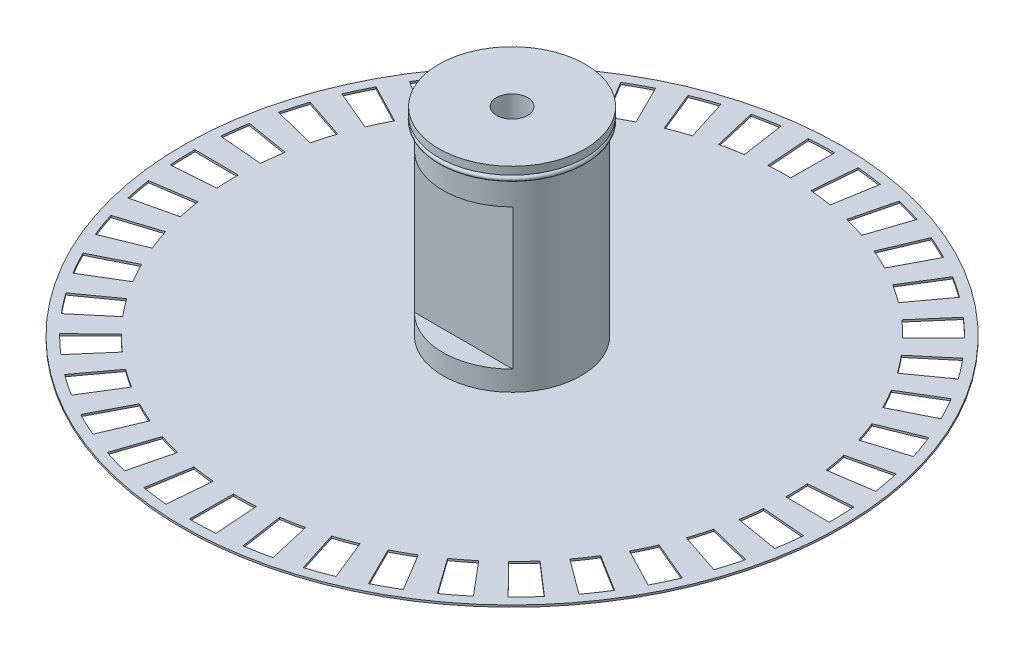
from build123d import *

# Parameters (mm, degrees)
ENL_V_MAT_EXTRU_1_DEPTH = 53.349689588
ESQUISSE3_W             = 23.080087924
ESQUISSE3_H             = 14.488991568
ENL_V_MAT_EXTRU_2_DEPTH = 5


with BuildPart() as part:
    # Esquisse1 → R_volution1 (revolve)
    with BuildSketch(Plane.XY, mode=Mode.PRIVATE) as r_volution1_sk:
        with BuildLine():
            Line((-1.6, 0), (-24, 0))
            Line((-24, 0), (-24, 1.6))
            Line((-24, 1.6), (-34, 1.6))
            Line((-34, 1.6), (-34, 1.8))
            Line((-34, 1.8), (-7.125, 1.8))
            Line((-7.125, 1.8), (-7.125, 20.94))
            ThreePointArc((-7.125, 20.94), (-7.575, 21.09), (-7.125, 21.24))
            Line((-7.125, 21.24), (-7.125, 21.5))
            Line((-7.125, 21.5), (-7.5562444, 21.5))
            Line((-7.5562444, 21.5), (-7.5562444, 22.3))
            Line((-7.5562444, 22.3), (-1.6, 22.3))
            Line((-1.6, 22.3), (-1.6, 0))
        make_face()
    revolve(r_volution1_sk.sketch.rotate(Axis((0, 0, 0), (0, 1, 0)), 270), axis=Axis((0, 0, 0), (0, 1, 0)))

    # Esquisse2 → Enl_v. mat.-Extru.1 (cut, through all)
    with BuildSketch(Plane.XZ.offset(-1.6)):
        with BuildLine():
            Line((-0.248706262, 28.498914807), (-0.287975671, 32.998743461))
            ThreePointArc((-0.287975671, 32.998743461), (1.03655505, 32.983716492), (2.359415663, 32.915545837))
            Line((2.359415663, 32.915545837), (2.037677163, 28.427062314))
            ThreePointArc((2.037677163, 28.427062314), (0.895206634, 28.48593697), (-0.248706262, 28.498914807))
        make_face()
        with BuildLine():
            Line((4.212568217, 28.186952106), (4.877710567, 32.637523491))
            ThreePointArc((4.877710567, 32.637523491), (6.183583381, 32.415479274), (7.479493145, 32.14120692))
            Line((7.479493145, 32.14120692), (6.459562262, 27.758315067))
            ThreePointArc((6.459562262, 27.758315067), (5.340367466, 27.995186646), (4.212568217, 28.186952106))
        make_face()
        with BuildLine():
            Line((8.570115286, 27.180933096), (9.923291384, 31.472659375))
            ThreePointArc((9.923291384, 31.472659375), (11.178351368, 31.049065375), (12.415400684, 30.575444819))
            Line((12.415400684, 30.575444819), (10.722391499, 26.40606598))
            ThreePointArc((10.722391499, 26.40606598), (9.654030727, 26.815101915), (8.570115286, 27.180933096))
        make_face()
        with BuildLine():
            Line((12.716637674, 25.505629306), (14.724527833, 29.532833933))
            ThreePointArc((14.724527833, 29.532833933), (15.897871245, 28.918120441), (17.045599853, 28.256813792))
            Line((17.045599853, 28.256813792), (14.721199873, 24.403611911))
            ThreePointArc((14.721199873, 24.403611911), (13.729979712, 24.974740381), (12.716637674, 25.505629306))
        make_face()
        with BuildLine():
            Line((16.550034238, 23.202292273), (19.163197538, 26.865812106))
            ThreePointArc((19.163197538, 26.865812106), (20.225932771, 26.075115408), (21.256079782, 25.24240623))
            Line((21.256079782, 25.24240623), (18.357523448, 21.800259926))
            ThreePointArc((18.357523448, 21.800259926), (17.467851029, 22.519417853), (16.550034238, 23.202292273))
        make_face()
        with BuildLine():
            Line((19.975914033, 20.327637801), (23.130005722, 23.537264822))
            ThreePointArc((23.130005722, 23.537264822), (24.055964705, 22.590054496), (24.943164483, 21.606446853))
            Line((24.943164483, 21.606446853), (21.541823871, 18.660113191))
            ThreePointArc((21.541823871, 18.660113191), (20.775605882, 19.509592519), (19.975914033, 20.327637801))
        make_face()
        with BuildLine():
            Line((22.909920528, 16.952449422), (26.5272764, 19.629151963))
            ThreePointArc((26.5272764, 19.629151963), (27.293658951, 18.548751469), (28.016065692, 17.438465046))
            Line((28.016065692, 17.438465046), (24.195693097, 15.06049254))
            ThreePointArc((24.195693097, 15.06049254), (23.571796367, 16.019376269), (22.909920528, 16.952449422))
        make_face()
        with BuildLine():
            Line((25.279808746, 13.159835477), (29.271357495, 15.237704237))
            ThreePointArc((29.271357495, 15.237704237), (29.859292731, 14.050716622), (30.399118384, 12.841090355))
            Line((30.399118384, 12.841090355), (26.253784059, 11.090032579))
            ThreePointArc((26.253784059, 11.090032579), (25.787570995, 12.13470981), (25.279808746, 13.159835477))
        make_face()
        with BuildLine():
            Line((27.027224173, 9.043182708), (31.294680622, 10.471053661))
            ThreePointArc((31.294680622, 10.471053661), (31.689691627, 9.206706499), (32.033643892, 7.927525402))
            Line((32.033643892, 7.927525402), (27.665419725, 6.846499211))
            ThreePointArc((27.665419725, 6.846499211), (27.368370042, 7.951246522), (27.027224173, 9.043182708))
        make_face()
        with BuildLine():
            Line((28.109139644, 4.703856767), (32.547424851, 5.446570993))
            ThreePointArc((32.547424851, 5.446570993), (32.739785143, 4.135996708), (32.879394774, 2.818758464))
            Line((32.879394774, 2.818758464), (28.395840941, 2.434382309))
            ThreePointArc((28.395840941, 2.434382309), (28.275268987, 3.571997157), (28.109139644, 4.703856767))
        make_face()
        with BuildLine():
            Line((28.498914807, 0.248706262), (32.998743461, 0.287975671))
            ThreePointArc((32.998743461, 0.287975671), (32.983716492, -1.03655505), (32.915545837, -2.359415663))
            Line((32.915545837, -2.359415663), (28.427062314, -2.037677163))
            ThreePointArc((28.427062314, -2.037677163), (28.48593697, -0.895206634), (28.498914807, 0.248706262))
        make_face()
        with BuildLine():
            Line((28.186952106, -4.212568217), (32.637523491, -4.877710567))
            ThreePointArc((32.637523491, -4.877710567), (32.415479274, -6.183583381), (32.14120692, -7.479493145))
            Line((32.14120692, -7.479493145), (27.758315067, -6.459562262))
            ThreePointArc((27.758315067, -6.459562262), (27.995186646, -5.340367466), (28.186952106, -4.212568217))
        make_face()
        with BuildLine():
            Line((27.180933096, -8.570115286), (31.472659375, -9.923291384))
            ThreePointArc((31.472659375, -9.923291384), (31.049065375, -11.178351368), (30.575444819, -12.415400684))
            Line((30.575444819, -12.415400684), (26.40606598, -10.722391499))
            ThreePointArc((26.40606598, -10.722391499), (26.815101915, -9.654030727), (27.180933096, -8.570115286))
        make_face()
        with BuildLine():
            Line((25.505629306, -12.716637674), (29.532833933, -14.724527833))
            ThreePointArc((29.532833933, -14.724527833), (28.918120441, -15.897871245), (28.256813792, -17.045599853))
            Line((28.256813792, -17.045599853), (24.403611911, -14.721199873))
            ThreePointArc((24.403611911, -14.721199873), (24.974740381, -13.729979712), (25.505629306, -12.716637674))
        make_face()
        with BuildLine():
            Line((23.202292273, -16.550034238), (26.865812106, -19.163197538))
            ThreePointArc((26.865812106, -19.163197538), (26.075115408, -20.225932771), (25.24240623, -21.256079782))
            Line((25.24240623, -21.256079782), (21.800259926, -18.357523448))
            ThreePointArc((21.800259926, -18.357523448), (22.519417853, -17.467851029), (23.202292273, -16.550034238))
        make_face()
        with BuildLine():
            Line((20.327637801, -19.975914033), (23.537264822, -23.130005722))
            ThreePointArc((23.537264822, -23.130005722), (22.590054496, -24.055964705), (21.606446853, -24.943164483))
            Line((21.606446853, -24.943164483), (18.660113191, -21.541823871))
            ThreePointArc((18.660113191, -21.541823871), (19.509592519, -20.775605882), (20.327637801, -19.975914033))
        make_face()
        with BuildLine():
            Line((16.952449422, -22.909920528), (19.629151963, -26.5272764))
            ThreePointArc((19.629151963, -26.5272764), (18.548751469, -27.293658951), (17.438465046, -28.016065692))
            Line((17.438465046, -28.016065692), (15.06049254, -24.195693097))
            ThreePointArc((15.06049254, -24.195693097), (16.019376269, -23.571796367), (16.952449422, -22.909920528))
        make_face()
        with BuildLine():
            Line((13.159835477, -25.279808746), (15.237704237, -29.271357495))
            ThreePointArc((15.237704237, -29.271357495), (14.050716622, -29.859292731), (12.841090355, -30.399118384))
            Line((12.841090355, -30.399118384), (11.090032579, -26.253784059))
            ThreePointArc((11.090032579, -26.253784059), (12.13470981, -25.787570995), (13.159835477, -25.279808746))
        make_face()
        with BuildLine():
            Line((9.043182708, -27.027224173), (10.471053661, -31.294680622))
            ThreePointArc((10.471053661, -31.294680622), (9.206706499, -31.689691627), (7.927525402, -32.033643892))
            Line((7.927525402, -32.033643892), (6.846499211, -27.665419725))
            ThreePointArc((6.846499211, -27.665419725), (7.951246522, -27.368370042), (9.043182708, -27.027224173))
        make_face()
        with BuildLine():
            Line((4.703856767, -28.109139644), (5.446570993, -32.547424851))
            ThreePointArc((5.446570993, -32.547424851), (4.135996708, -32.739785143), (2.818758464, -32.879394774))
            Line((2.818758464, -32.879394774), (2.434382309, -28.395840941))
            ThreePointArc((2.434382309, -28.395840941), (3.571997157, -28.275268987), (4.703856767, -28.109139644))
        make_face()
        with BuildLine():
            Line((0.248706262, -28.498914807), (0.287975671, -32.998743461))
            ThreePointArc((0.287975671, -32.998743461), (-1.03655505, -32.983716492), (-2.359415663, -32.915545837))
            Line((-2.359415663, -32.915545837), (-2.037677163, -28.427062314))
            ThreePointArc((-2.037677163, -28.427062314), (-0.895206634, -28.48593697), (0.248706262, -28.498914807))
        make_face()
        with BuildLine():
            Line((-4.212568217, -28.186952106), (-4.877710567, -32.637523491))
            ThreePointArc((-4.877710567, -32.637523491), (-6.183583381, -32.415479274), (-7.479493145, -32.14120692))
            Line((-7.479493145, -32.14120692), (-6.459562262, -27.758315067))
            ThreePointArc((-6.459562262, -27.758315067), (-5.340367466, -27.995186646), (-4.212568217, -28.186952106))
        make_face()
        with BuildLine():
            Line((-8.570115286, -27.180933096), (-9.923291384, -31.472659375))
            ThreePointArc((-9.923291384, -31.472659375), (-11.178351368, -31.049065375), (-12.415400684, -30.575444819))
            Line((-12.415400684, -30.575444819), (-10.722391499, -26.40606598))
            ThreePointArc((-10.722391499, -26.40606598), (-9.654030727, -26.815101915), (-8.570115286, -27.180933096))
        make_face()
        with BuildLine():
            Line((-12.716637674, -25.505629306), (-14.724527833, -29.532833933))
            ThreePointArc((-14.724527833, -29.532833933), (-15.897871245, -28.918120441), (-17.045599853, -28.256813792))
            Line((-17.045599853, -28.256813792), (-14.721199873, -24.403611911))
            ThreePointArc((-14.721199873, -24.403611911), (-13.729979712, -24.974740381), (-12.716637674, -25.505629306))
        make_face()
        with BuildLine():
            Line((-16.550034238, -23.202292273), (-19.163197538, -26.865812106))
            ThreePointArc((-19.163197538, -26.865812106), (-20.225932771, -26.075115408), (-21.256079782, -25.24240623))
            Line((-21.256079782, -25.24240623), (-18.357523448, -21.800259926))
            ThreePointArc((-18.357523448, -21.800259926), (-17.467851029, -22.519417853), (-16.550034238, -23.202292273))
        make_face()
        with BuildLine():
            Line((-19.975914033, -20.327637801), (-23.130005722, -23.537264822))
            ThreePointArc((-23.130005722, -23.537264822), (-24.055964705, -22.590054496), (-24.943164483, -21.606446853))
            Line((-24.943164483, -21.606446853), (-21.541823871, -18.660113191))
            ThreePointArc((-21.541823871, -18.660113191), (-20.775605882, -19.509592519), (-19.975914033, -20.327637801))
        make_face()
        with BuildLine():
            Line((-22.909920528, -16.952449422), (-26.5272764, -19.629151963))
            ThreePointArc((-26.5272764, -19.629151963), (-27.293658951, -18.548751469), (-28.016065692, -17.438465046))
            Line((-28.016065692, -17.438465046), (-24.195693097, -15.06049254))
            ThreePointArc((-24.195693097, -15.06049254), (-23.571796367, -16.019376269), (-22.909920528, -16.952449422))
        make_face()
        with BuildLine():
            Line((-25.279808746, -13.159835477), (-29.271357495, -15.237704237))
            ThreePointArc((-29.271357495, -15.237704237), (-29.859292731, -14.050716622), (-30.399118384, -12.841090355))
            Line((-30.399118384, -12.841090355), (-26.253784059, -11.090032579))
            ThreePointArc((-26.253784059, -11.090032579), (-25.787570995, -12.13470981), (-25.279808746, -13.159835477))
        make_face()
        with BuildLine():
            Line((-27.027224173, -9.043182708), (-31.294680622, -10.471053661))
            ThreePointArc((-31.294680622, -10.471053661), (-31.689691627, -9.206706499), (-32.033643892, -7.927525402))
            Line((-32.033643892, -7.927525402), (-27.665419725, -6.846499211))
            ThreePointArc((-27.665419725, -6.846499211), (-27.368370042, -7.951246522), (-27.027224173, -9.043182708))
        make_face()
        with BuildLine():
            Line((-28.109139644, -4.703856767), (-32.547424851, -5.446570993))
            ThreePointArc((-32.547424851, -5.446570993), (-32.739785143, -4.135996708), (-32.879394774, -2.818758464))
            Line((-32.879394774, -2.818758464), (-28.395840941, -2.434382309))
            ThreePointArc((-28.395840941, -2.434382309), (-28.275268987, -3.571997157), (-28.109139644, -4.703856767))
        make_face()
        with BuildLine():
            Line((-28.498914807, -0.248706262), (-32.998743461, -0.287975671))
            ThreePointArc((-32.998743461, -0.287975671), (-32.983716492, 1.03655505), (-32.915545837, 2.359415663))
            Line((-32.915545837, 2.359415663), (-28.427062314, 2.037677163))
            ThreePointArc((-28.427062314, 2.037677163), (-28.48593697, 0.895206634), (-28.498914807, -0.248706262))
        make_face()
        with BuildLine():
            Line((-28.186952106, 4.212568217), (-32.637523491, 4.877710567))
            ThreePointArc((-32.637523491, 4.877710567), (-32.415479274, 6.183583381), (-32.14120692, 7.479493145))
            Line((-32.14120692, 7.479493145), (-27.758315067, 6.459562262))
            ThreePointArc((-27.758315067, 6.459562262), (-27.995186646, 5.340367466), (-28.186952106, 4.212568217))
        make_face()
        with BuildLine():
            Line((-27.180933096, 8.570115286), (-31.472659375, 9.923291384))
            ThreePointArc((-31.472659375, 9.923291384), (-31.049065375, 11.178351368), (-30.575444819, 12.415400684))
            Line((-30.575444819, 12.415400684), (-26.40606598, 10.722391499))
            ThreePointArc((-26.40606598, 10.722391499), (-26.815101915, 9.654030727), (-27.180933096, 8.570115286))
        make_face()
        with BuildLine():
            Line((-25.505629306, 12.716637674), (-29.532833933, 14.724527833))
            ThreePointArc((-29.532833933, 14.724527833), (-28.918120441, 15.897871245), (-28.256813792, 17.045599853))
            Line((-28.256813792, 17.045599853), (-24.403611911, 14.721199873))
            ThreePointArc((-24.403611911, 14.721199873), (-24.974740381, 13.729979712), (-25.505629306, 12.716637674))
        make_face()
        with BuildLine():
            Line((-23.202292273, 16.550034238), (-26.865812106, 19.163197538))
            ThreePointArc((-26.865812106, 19.163197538), (-26.075115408, 20.225932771), (-25.24240623, 21.256079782))
            Line((-25.24240623, 21.256079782), (-21.800259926, 18.357523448))
            ThreePointArc((-21.800259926, 18.357523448), (-22.519417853, 17.467851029), (-23.202292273, 16.550034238))
        make_face()
        with BuildLine():
            Line((-20.327637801, 19.975914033), (-23.537264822, 23.130005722))
            ThreePointArc((-23.537264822, 23.130005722), (-22.590054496, 24.055964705), (-21.606446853, 24.943164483))
            Line((-21.606446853, 24.943164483), (-18.660113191, 21.541823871))
            ThreePointArc((-18.660113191, 21.541823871), (-19.509592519, 20.775605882), (-20.327637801, 19.975914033))
        make_face()
        with BuildLine():
            Line((-16.952449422, 22.909920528), (-19.629151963, 26.5272764))
            ThreePointArc((-19.629151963, 26.5272764), (-18.548751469, 27.293658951), (-17.438465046, 28.016065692))
            Line((-17.438465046, 28.016065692), (-15.06049254, 24.195693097))
            ThreePointArc((-15.06049254, 24.195693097), (-16.019376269, 23.571796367), (-16.952449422, 22.909920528))
        make_face()
        with BuildLine():
            Line((-13.159835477, 25.279808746), (-15.237704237, 29.271357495))
            ThreePointArc((-15.237704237, 29.271357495), (-14.050716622, 29.859292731), (-12.841090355, 30.399118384))
            Line((-12.841090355, 30.399118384), (-11.090032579, 26.253784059))
            ThreePointArc((-11.090032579, 26.253784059), (-12.13470981, 25.787570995), (-13.159835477, 25.279808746))
        make_face()
        with BuildLine():
            Line((-9.043182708, 27.027224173), (-10.471053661, 31.294680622))
            ThreePointArc((-10.471053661, 31.294680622), (-9.206706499, 31.689691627), (-7.927525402, 32.033643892))
            Line((-7.927525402, 32.033643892), (-6.846499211, 27.665419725))
            ThreePointArc((-6.846499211, 27.665419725), (-7.951246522, 27.368370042), (-9.043182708, 27.027224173))
        make_face()
        with BuildLine():
            Line((-4.703856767, 28.109139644), (-5.446570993, 32.547424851))
            ThreePointArc((-5.446570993, 32.547424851), (-4.135996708, 32.739785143), (-2.818758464, 32.879394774))
            Line((-2.818758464, 32.879394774), (-2.434382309, 28.395840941))
            ThreePointArc((-2.434382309, 28.395840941), (-3.571997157, 28.275268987), (-4.703856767, 28.109139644))
        make_face()
    extrude(amount=-ENL_V_MAT_EXTRU_1_DEPTH, mode=Mode.SUBTRACT)

    # Esquisse3 → Enl_v. mat.-Extru.2 (cut)
    with BuildSketch(Plane.XY.offset(10)):
        with Locations((-0.016719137, 11.1178377)):
            Rectangle(ESQUISSE3_W, ESQUISSE3_H)
    extrude(amount=-ENL_V_MAT_EXTRU_2_DEPTH, mode=Mode.SUBTRACT)


solid = part.part
